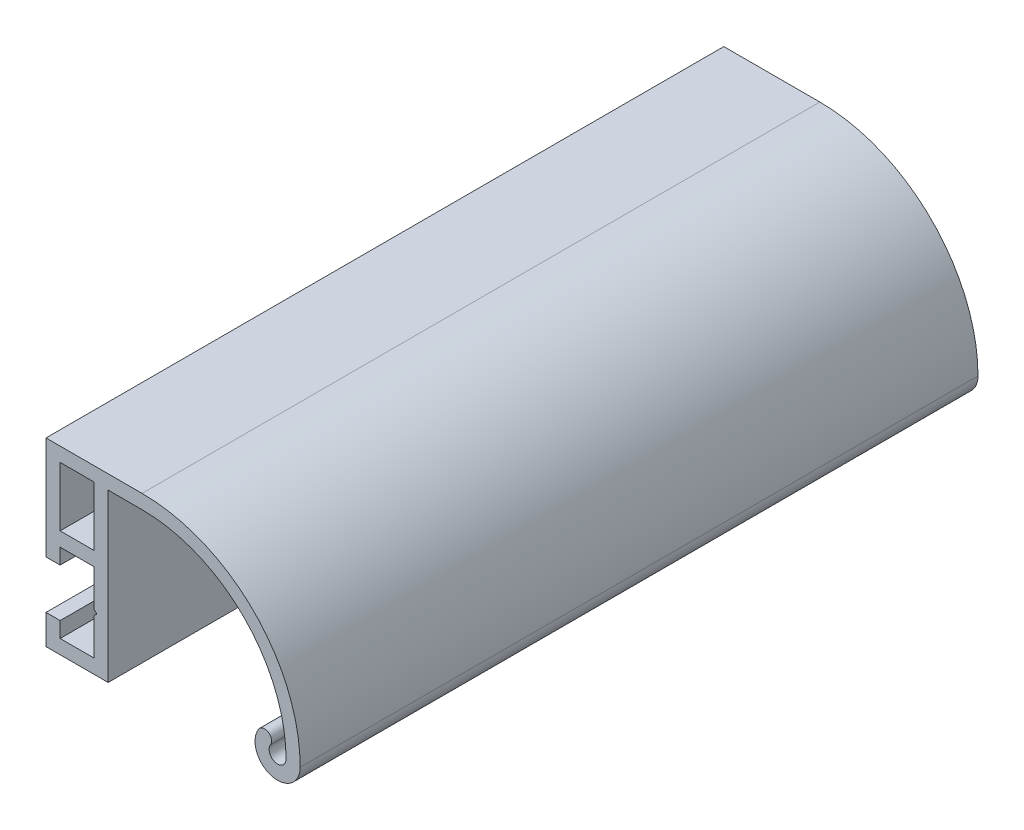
from build123d import *

# Parameters (mm, degrees)
EXTRUDE1_DEPTH      = 60
EXTRUDE1_DEPTH_BACK = 60
SKETCH1_W           = 6
SKETCH1_H           = 10.499998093


with BuildPart() as part:
    # Sketch1 → Extrude1 (new, two sides: drawn at the far end of the back side and taken through both)
    with BuildSketch(Plane.XY.offset(-EXTRUDE1_DEPTH_BACK)):
        with BuildLine():
            Line((-22.499999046, -4.25), (-22.499999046, -9.5))
            Line((-22.499999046, -9.5), (-11.499999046, -9.5))
            Line((-11.499999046, -9.5), (-11.499999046, 19.999997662))
            Line((-11.499999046, 19.999997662), (-5.499999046, 19.999997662))
            ThreePointArc((-5.499999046, 19.999997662), (12.531222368, 12.531221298), (19.999999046, -5.499999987))
            ThreePointArc((19.999999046, -5.499999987), (18.074423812, -6.93836316), (17.241482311, -4.683826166))
            ThreePointArc((17.241482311, -4.683826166), (16.872864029, -2.954918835), (15.143956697, -3.323537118))
            ThreePointArc((15.143956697, -3.323537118), (17.365133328, -9.335633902), (22.499999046, -5.5))
            ThreePointArc((22.499999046, -5.5), (14.298989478, 14.298988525), (-5.499999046, 22.499998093))
            Line((-5.499999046, 22.499998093), (-22.499999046, 22.499998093))
            Line((-22.499999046, 22.499998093), (-22.499999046, 4.25))
            Line((-22.499999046, 4.25), (-19.999999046, 4.25))
            Line((-19.999999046, 4.25), (-19.999999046, 7))
            Line((-19.999999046, 7), (-13.999999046, 7))
            Line((-13.999999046, 7), (-13.999999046, 0.5))
            Line((-13.999999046, 0.5), (-13.499999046, 0))
            Line((-13.499999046, 0), (-13.999999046, -0.5))
            Line((-13.999999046, -0.5), (-13.999999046, -7))
            Line((-13.999999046, -7), (-19.999999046, -7))
            Line((-19.999999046, -7), (-19.999999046, -4.25))
            Line((-19.999999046, -4.25), (-22.499999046, -4.25))
        make_face()
        with Locations((-16.999999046, 14.749999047)):
            Rectangle(SKETCH1_W, SKETCH1_H, mode=Mode.SUBTRACT)
    extrude(amount=EXTRUDE1_DEPTH + EXTRUDE1_DEPTH_BACK)


solid = part.part
